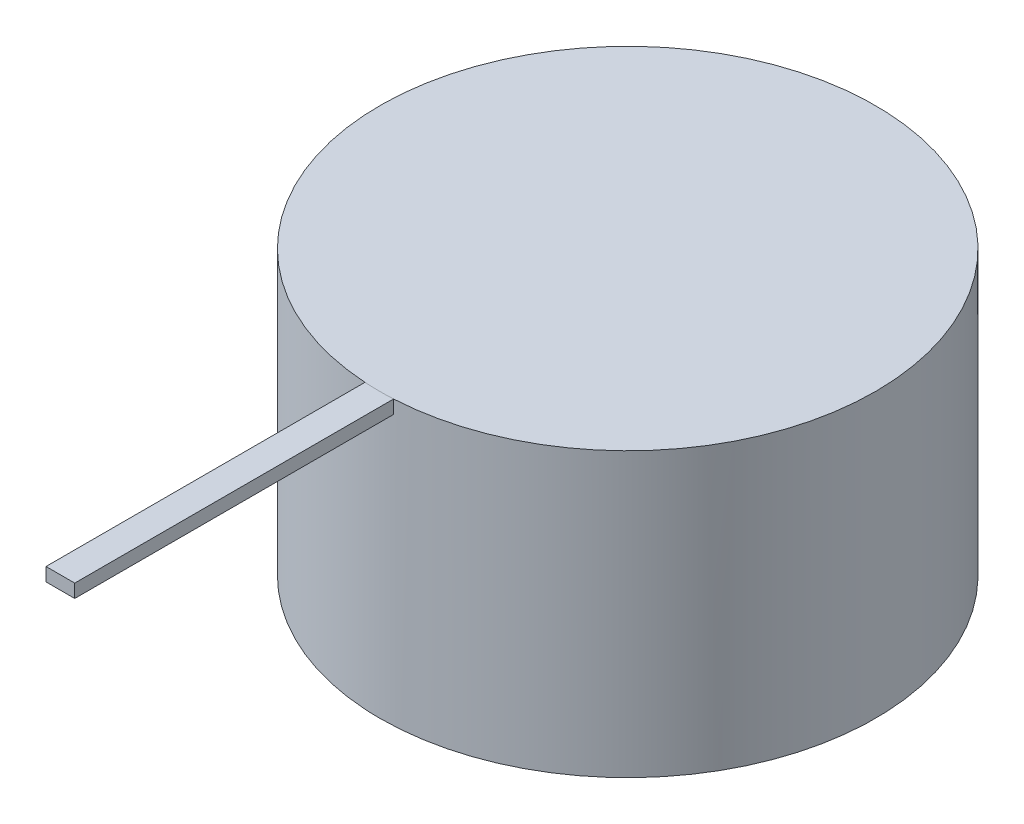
from build123d import *

# Parameters (mm, degrees)
SKETCH1_R      = 2.29235
EXTRUDE1_DEPTH = 1.21793
SKETCH2_R      = 4.445
EXTRUDE2_DEPTH = 5.08
SKETCH3_W      = 0.51567689
SKETCH3_H      = 0.239809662
EXTRUDE3_DEPTH = 10.16


with BuildPart() as part:
    # Sketch1 → Extrude1 (new body)
    with BuildSketch(Plane(origin=(0, 0, 0), x_dir=(1, 0, 0), z_dir=(0, 1, 0))):
        with Locations(Location((0, 0, 0), (0, 0, 270))):
            Circle(SKETCH1_R)
    extrude(amount=EXTRUDE1_DEPTH)

    # Sketch2 → Extrude2 (add)
    with BuildSketch(Plane(origin=(0, 1.21793, 0), x_dir=(-1, 0, 0), z_dir=(0, 1, 0))):
        with Locations(Location((0, 0, 0), (0, 0, 90))):
            Circle(SKETCH2_R)
    extrude(amount=EXTRUDE2_DEPTH)

    # Sketch3 → Extrude3 (add)
    with BuildSketch(Plane.XY):
        with Locations((-0.020355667, 6.178025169)):
            Rectangle(SKETCH3_W, SKETCH3_H)
    extrude(amount=EXTRUDE3_DEPTH)


solid = part.part
